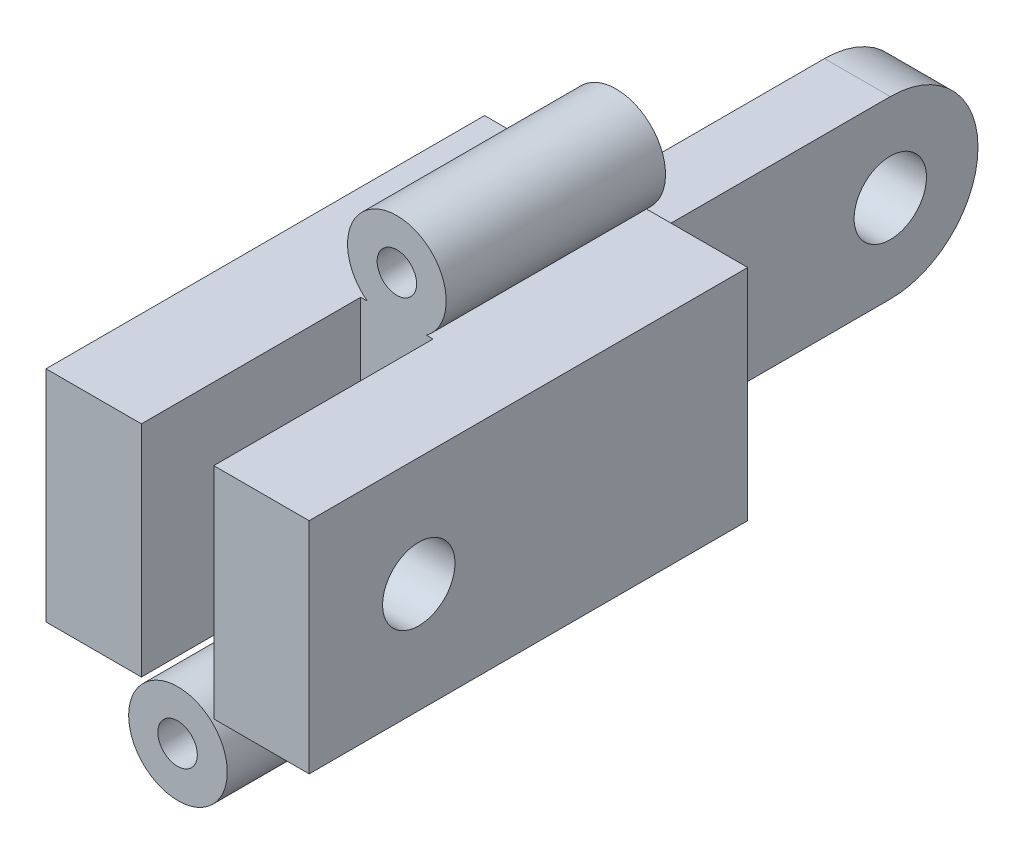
ISO-10303-21;
HEADER;
FILE_DESCRIPTION(('STEP AP214'),'2;1');
FILE_NAME('part.step','',(''),(''),'','','');
FILE_SCHEMA(('AUTOMOTIVE_DESIGN { 1 0 10303 214 1 1 1 1 }'));
ENDSEC;
DATA;
#1=APPLICATION_CONTEXT('core data for automotive mechanical design processes');
#2=APPLICATION_PROTOCOL_DEFINITION('international standard','automotive_design',2000,#1);
#3=PRODUCT_CONTEXT('',#1,'mechanical');
#4=PRODUCT('Part','Part','',(#3));
#5=PRODUCT_RELATED_PRODUCT_CATEGORY('part','',(#4));
#6=PRODUCT_DEFINITION_FORMATION('','',#4);
#7=PRODUCT_DEFINITION_CONTEXT('part definition',#1,'design');
#8=PRODUCT_DEFINITION('design','',#6,#7);
#9=PRODUCT_DEFINITION_SHAPE('','',#8);
#10=(LENGTH_UNIT() NAMED_UNIT(*) SI_UNIT(.MILLI.,.METRE.));
#11=(NAMED_UNIT(*) PLANE_ANGLE_UNIT() SI_UNIT($,.RADIAN.));
#12=(NAMED_UNIT(*) SI_UNIT($,.STERADIAN.) SOLID_ANGLE_UNIT());
#13=UNCERTAINTY_MEASURE_WITH_UNIT(LENGTH_MEASURE(1.E-05),#10,'distance_accuracy_value','');
#14=(GEOMETRIC_REPRESENTATION_CONTEXT(3) GLOBAL_UNCERTAINTY_ASSIGNED_CONTEXT((#13)) GLOBAL_UNIT_ASSIGNED_CONTEXT((#10,
#11,#12)) REPRESENTATION_CONTEXT('',''));
#15=CARTESIAN_POINT('',(0.,0.,0.));
#16=DIRECTION('',(0.,0.,1.));
#17=DIRECTION('',(1.,0.,0.));
#18=AXIS2_PLACEMENT_3D('',#15,#16,#17);
#19=CARTESIAN_POINT('',(0.,0.,0.));
#20=DIRECTION('',(0.,-1.,0.));
#21=DIRECTION('',(0.,0.,-1.));
#22=AXIS2_PLACEMENT_3D('',#19,#20,#21);
#23=PLANE('',#22);
#24=DIRECTION('',(0.,0.,-1.));
#25=VECTOR('',#24,1.);
#26=CARTESIAN_POINT('',(4.66804126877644,0.,0.));
#27=LINE('',#26,#25);
#28=CARTESIAN_POINT('',(4.66804126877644,0.,-10.));
#29=VERTEX_POINT('',#28);
#30=CARTESIAN_POINT('',(4.66804126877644,0.,-20.));
#31=VERTEX_POINT('',#30);
#32=EDGE_CURVE('E11',#29,#31,#27,.T.);
#33=ORIENTED_EDGE('',*,*,#32,.F.);
#34=DIRECTION('',(1.,0.,0.));
#35=VECTOR('',#34,1.);
#36=CARTESIAN_POINT('',(4.35,0.,-10.));
#37=LINE('',#36,#35);
#38=CARTESIAN_POINT('',(4.35,0.,-10.));
#39=VERTEX_POINT('',#38);
#40=EDGE_CURVE('E363',#39,#29,#37,.T.);
#41=ORIENTED_EDGE('',*,*,#40,.F.);
#42=DIRECTION('',(0.,0.,-1.));
#43=VECTOR('',#42,1.);
#44=CARTESIAN_POINT('',(4.35,0.,0.));
#45=LINE('',#44,#43);
#46=CARTESIAN_POINT('',(4.35,0.,0.));
#47=VERTEX_POINT('',#46);
#48=EDGE_CURVE('E360',#47,#39,#45,.T.);
#49=ORIENTED_EDGE('',*,*,#48,.F.);
#50=DIRECTION('',(1.,0.,0.));
#51=VECTOR('',#50,1.);
#52=CARTESIAN_POINT('',(0.,0.,0.));
#53=LINE('',#52,#51);
#54=CARTESIAN_POINT('',(0.,0.,0.));
#55=VERTEX_POINT('',#54);
#56=EDGE_CURVE('E357',#55,#47,#53,.T.);
#57=ORIENTED_EDGE('',*,*,#56,.F.);
#58=DIRECTION('',(0.,0.,1.));
#59=VECTOR('',#58,1.);
#60=CARTESIAN_POINT('',(0.,0.,0.));
#61=LINE('',#60,#59);
#62=CARTESIAN_POINT('',(0.,0.,-20.));
#63=VERTEX_POINT('',#62);
#64=EDGE_CURVE('E244',#63,#55,#61,.T.);
#65=ORIENTED_EDGE('',*,*,#64,.F.);
#66=DIRECTION('',(-1.,0.,0.));
#67=VECTOR('',#66,1.);
#68=CARTESIAN_POINT('',(0.,0.,-20.));
#69=LINE('',#68,#67);
#70=EDGE_CURVE('E189',#31,#63,#69,.T.);
#71=ORIENTED_EDGE('',*,*,#70,.F.);
#72=EDGE_LOOP('',(#33,#41,#49,#57,#65,#71));
#73=FACE_BOUND('',#72,.T.);
#74=ADVANCED_FACE('F45',(#73),#23,.T.);
#75=CARTESIAN_POINT('',(0.,10.,0.));
#76=DIRECTION('',(0.,-1.,0.));
#77=DIRECTION('',(0.,0.,-1.));
#78=AXIS2_PLACEMENT_3D('',#75,#76,#77);
#79=PLANE('',#78);
#80=DIRECTION('',(-1.,0.,0.));
#81=VECTOR('',#80,1.);
#82=CARTESIAN_POINT('',(12.,10.,-20.));
#83=LINE('',#82,#81);
#84=CARTESIAN_POINT('',(12.,10.,-20.));
#85=VERTEX_POINT('',#84);
#86=CARTESIAN_POINT('',(7.35,10.,-20.));
#87=VERTEX_POINT('',#86);
#88=EDGE_CURVE('E205',#85,#87,#83,.T.);
#89=ORIENTED_EDGE('',*,*,#88,.T.);
#90=DIRECTION('',(0.,0.,1.));
#91=VECTOR('',#90,1.);
#92=CARTESIAN_POINT('',(7.35,10.,-20.));
#93=LINE('',#92,#91);
#94=CARTESIAN_POINT('',(7.35,10.,-10.));
#95=VERTEX_POINT('',#94);
#96=EDGE_CURVE('E180',#87,#95,#93,.T.);
#97=ORIENTED_EDGE('',*,*,#96,.T.);
#98=DIRECTION('',(1.,0.,0.));
#99=VECTOR('',#98,1.);
#100=CARTESIAN_POINT('',(4.35,10.,-10.));
#101=LINE('',#100,#99);
#102=CARTESIAN_POINT('',(7.65,10.,-10.));
#103=VERTEX_POINT('',#102);
#104=EDGE_CURVE('E279',#95,#103,#101,.T.);
#105=ORIENTED_EDGE('',*,*,#104,.T.);
#106=DIRECTION('',(0.,0.,1.));
#107=VECTOR('',#106,1.);
#108=CARTESIAN_POINT('',(7.65,10.,0.));
#109=LINE('',#108,#107);
#110=CARTESIAN_POINT('',(7.65,10.,0.));
#111=VERTEX_POINT('',#110);
#112=EDGE_CURVE('E342',#103,#111,#109,.T.);
#113=ORIENTED_EDGE('',*,*,#112,.T.);
#114=DIRECTION('',(1.,0.,0.));
#115=VECTOR('',#114,1.);
#116=CARTESIAN_POINT('',(7.65,10.,0.));
#117=LINE('',#116,#115);
#118=CARTESIAN_POINT('',(12.,10.,0.));
#119=VERTEX_POINT('',#118);
#120=EDGE_CURVE('E345',#111,#119,#117,.T.);
#121=ORIENTED_EDGE('',*,*,#120,.T.);
#122=DIRECTION('',(0.,0.,-1.));
#123=VECTOR('',#122,1.);
#124=CARTESIAN_POINT('',(12.,10.,0.));
#125=LINE('',#124,#123);
#126=EDGE_CURVE('E348',#119,#85,#125,.T.);
#127=ORIENTED_EDGE('',*,*,#126,.T.);
#128=EDGE_LOOP('',(#89,#97,#105,#113,#121,#127));
#129=FACE_BOUND('',#128,.T.);
#130=ADVANCED_FACE('F278',(#129),#79,.F.);
#131=CARTESIAN_POINT('',(0.,10.,0.));
#132=DIRECTION('',(1.,0.,0.));
#133=DIRECTION('',(0.,0.,-1.));
#134=AXIS2_PLACEMENT_3D('',#131,#132,#133);
#135=PLANE('',#134);
#136=CARTESIAN_POINT('',(0.,5.,-5.));
#137=DIRECTION('',(1.,0.,0.));
#138=DIRECTION('',(0.,0.,-1.));
#139=AXIS2_PLACEMENT_3D('',#136,#137,#138);
#140=CIRCLE('',#139,1.65);
#141=CARTESIAN_POINT('',(0.,5.,-6.65));
#142=VERTEX_POINT('',#141);
#143=EDGE_CURVE('E298',#142,#142,#140,.T.);
#144=ORIENTED_EDGE('',*,*,#143,.T.);
#145=EDGE_LOOP('',(#144));
#146=FACE_BOUND('',#145,.T.);
#147=ORIENTED_EDGE('',*,*,#64,.T.);
#148=DIRECTION('',(0.,-1.,0.));
#149=VECTOR('',#148,1.);
#150=CARTESIAN_POINT('',(0.,10.,0.));
#151=LINE('',#150,#149);
#152=CARTESIAN_POINT('',(0.,10.,0.));
#153=VERTEX_POINT('',#152);
#154=EDGE_CURVE('E235',#153,#55,#151,.T.);
#155=ORIENTED_EDGE('',*,*,#154,.F.);
#156=DIRECTION('',(0.,0.,1.));
#157=VECTOR('',#156,1.);
#158=CARTESIAN_POINT('',(0.,10.,0.));
#159=LINE('',#158,#157);
#160=CARTESIAN_POINT('',(0.,10.,-20.));
#161=VERTEX_POINT('',#160);
#162=EDGE_CURVE('E188',#161,#153,#159,.T.);
#163=ORIENTED_EDGE('',*,*,#162,.F.);
#164=DIRECTION('',(0.,-1.,0.));
#165=VECTOR('',#164,1.);
#166=CARTESIAN_POINT('',(0.,10.,-20.));
#167=LINE('',#166,#165);
#168=EDGE_CURVE('E200',#161,#63,#167,.T.);
#169=ORIENTED_EDGE('',*,*,#168,.T.);
#170=EDGE_LOOP('',(#147,#155,#163,#169));
#171=FACE_BOUND('',#170,.T.);
#172=ADVANCED_FACE('F406',(#146,#171),#135,.F.);
#173=CARTESIAN_POINT('',(0.,10.,0.));
#174=DIRECTION('',(0.,0.,-1.));
#175=DIRECTION('',(-1.,0.,0.));
#176=AXIS2_PLACEMENT_3D('',#173,#174,#175);
#177=PLANE('',#176);
#178=ORIENTED_EDGE('',*,*,#56,.T.);
#179=DIRECTION('',(0.,-1.,0.));
#180=VECTOR('',#179,1.);
#181=CARTESIAN_POINT('',(4.35,10.,0.));
#182=LINE('',#181,#180);
#183=CARTESIAN_POINT('',(4.35,10.,0.));
#184=VERTEX_POINT('',#183);
#185=EDGE_CURVE('E231',#184,#47,#182,.T.);
#186=ORIENTED_EDGE('',*,*,#185,.F.);
#187=DIRECTION('',(1.,0.,0.));
#188=VECTOR('',#187,1.);
#189=CARTESIAN_POINT('',(0.,10.,0.));
#190=LINE('',#189,#188);
#191=EDGE_CURVE('E194',#153,#184,#190,.T.);
#192=ORIENTED_EDGE('',*,*,#191,.F.);
#193=ORIENTED_EDGE('',*,*,#154,.T.);
#194=EDGE_LOOP('',(#178,#186,#192,#193));
#195=FACE_BOUND('',#194,.T.);
#196=ADVANCED_FACE('F495',(#195),#177,.F.);
#197=CARTESIAN_POINT('',(4.35,10.,0.));
#198=DIRECTION('',(-1.,0.,0.));
#199=DIRECTION('',(0.,0.,1.));
#200=AXIS2_PLACEMENT_3D('',#197,#198,#199);
#201=PLANE('',#200);
#202=CARTESIAN_POINT('',(4.35,5.,-5.));
#203=DIRECTION('',(-1.,0.,0.));
#204=DIRECTION('',(0.,0.,1.));
#205=AXIS2_PLACEMENT_3D('',#202,#203,#204);
#206=CIRCLE('',#205,1.65);
#207=CARTESIAN_POINT('',(4.35,5.,-6.65));
#208=VERTEX_POINT('',#207);
#209=EDGE_CURVE('E270',#208,#208,#206,.T.);
#210=ORIENTED_EDGE('',*,*,#209,.T.);
#211=EDGE_LOOP('',(#210));
#212=FACE_BOUND('',#211,.T.);
#213=ORIENTED_EDGE('',*,*,#48,.T.);
#214=DIRECTION('',(0.,-1.,0.));
#215=VECTOR('',#214,1.);
#216=CARTESIAN_POINT('',(4.35,10.,-10.));
#217=LINE('',#216,#215);
#218=CARTESIAN_POINT('',(4.35,10.,-10.));
#219=VERTEX_POINT('',#218);
#220=EDGE_CURVE('E227',#219,#39,#217,.T.);
#221=ORIENTED_EDGE('',*,*,#220,.F.);
#222=DIRECTION('',(0.,0.,-1.));
#223=VECTOR('',#222,1.);
#224=CARTESIAN_POINT('',(4.35,10.,0.));
#225=LINE('',#224,#223);
#226=EDGE_CURVE('E337',#184,#219,#225,.T.);
#227=ORIENTED_EDGE('',*,*,#226,.F.);
#228=ORIENTED_EDGE('',*,*,#185,.T.);
#229=EDGE_LOOP('',(#213,#221,#227,#228));
#230=FACE_BOUND('',#229,.T.);
#231=ADVANCED_FACE('F479',(#212,#230),#201,.F.);
#232=CARTESIAN_POINT('',(4.35,10.,-10.));
#233=DIRECTION('',(0.,0.,-1.));
#234=DIRECTION('',(-1.,0.,0.));
#235=AXIS2_PLACEMENT_3D('',#232,#233,#234);
#236=PLANE('',#235);
#237=CARTESIAN_POINT('',(6.,11.8,-10.));
#238=DIRECTION('',(0.,0.,-1.));
#239=DIRECTION('',(-1.,0.,0.));
#240=AXIS2_PLACEMENT_3D('',#237,#238,#239);
#241=CIRCLE('',#240,0.899999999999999);
#242=CARTESIAN_POINT('',(5.1,11.8,-10.));
#243=VERTEX_POINT('',#242);
#244=EDGE_CURVE('E169',#243,#243,#241,.T.);
#245=ORIENTED_EDGE('',*,*,#244,.T.);
#246=EDGE_LOOP('',(#245));
#247=FACE_BOUND('',#246,.T.);
#248=ORIENTED_EDGE('',*,*,#40,.T.);
#249=CARTESIAN_POINT('',(6.01804126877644,-1.8,-10.));
#250=DIRECTION('',(0.,0.,-1.));
#251=DIRECTION('',(-1.,0.,0.));
#252=AXIS2_PLACEMENT_3D('',#249,#250,#251);
#253=CIRCLE('',#252,2.25);
#254=CARTESIAN_POINT('',(7.36804126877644,0.,-10.));
#255=VERTEX_POINT('',#254);
#256=EDGE_CURVE('E290',#29,#255,#253,.T.);
#257=ORIENTED_EDGE('',*,*,#256,.T.);
#258=CARTESIAN_POINT('',(7.65,0.,-10.));
#259=VERTEX_POINT('',#258);
#260=EDGE_CURVE('E178',#255,#259,#37,.T.);
#261=ORIENTED_EDGE('',*,*,#260,.T.);
#262=DIRECTION('',(0.,-1.,0.));
#263=VECTOR('',#262,1.);
#264=CARTESIAN_POINT('',(7.65,10.,-10.));
#265=LINE('',#264,#263);
#266=EDGE_CURVE('E223',#103,#259,#265,.T.);
#267=ORIENTED_EDGE('',*,*,#266,.F.);
#268=ORIENTED_EDGE('',*,*,#104,.F.);
#269=CARTESIAN_POINT('',(6.,11.8,-10.));
#270=DIRECTION('',(0.,0.,1.));
#271=DIRECTION('',(1.,0.,0.));
#272=AXIS2_PLACEMENT_3D('',#269,#270,#271);
#273=CIRCLE('',#272,2.25);
#274=CARTESIAN_POINT('',(4.65,10.,-10.));
#275=VERTEX_POINT('',#274);
#276=EDGE_CURVE('E285',#95,#275,#273,.T.);
#277=ORIENTED_EDGE('',*,*,#276,.T.);
#278=EDGE_CURVE('E68',#219,#275,#101,.T.);
#279=ORIENTED_EDGE('',*,*,#278,.F.);
#280=ORIENTED_EDGE('',*,*,#220,.T.);
#281=EDGE_LOOP('',(#248,#257,#261,#267,#268,#277,#279,#280));
#282=FACE_BOUND('',#281,.T.);
#283=ADVANCED_FACE('F395',(#247,#282),#236,.F.);
#284=CARTESIAN_POINT('',(7.65,10.,0.));
#285=DIRECTION('',(1.,0.,0.));
#286=DIRECTION('',(0.,0.,-1.));
#287=AXIS2_PLACEMENT_3D('',#284,#285,#286);
#288=PLANE('',#287);
#289=CARTESIAN_POINT('',(7.65,5.,-5.));
#290=DIRECTION('',(1.,0.,0.));
#291=DIRECTION('',(0.,0.,-1.));
#292=AXIS2_PLACEMENT_3D('',#289,#290,#291);
#293=CIRCLE('',#292,1.65);
#294=CARTESIAN_POINT('',(7.65,5.,-6.65));
#295=VERTEX_POINT('',#294);
#296=EDGE_CURVE('E302',#295,#295,#293,.T.);
#297=ORIENTED_EDGE('',*,*,#296,.T.);
#298=EDGE_LOOP('',(#297));
#299=FACE_BOUND('',#298,.T.);
#300=DIRECTION('',(0.,0.,1.));
#301=VECTOR('',#300,1.);
#302=CARTESIAN_POINT('',(7.65,0.,0.));
#303=LINE('',#302,#301);
#304=CARTESIAN_POINT('',(7.65,0.,0.));
#305=VERTEX_POINT('',#304);
#306=EDGE_CURVE('E367',#259,#305,#303,.T.);
#307=ORIENTED_EDGE('',*,*,#306,.T.);
#308=DIRECTION('',(0.,-1.,0.));
#309=VECTOR('',#308,1.);
#310=CARTESIAN_POINT('',(7.65,10.,0.));
#311=LINE('',#310,#309);
#312=EDGE_CURVE('E219',#111,#305,#311,.T.);
#313=ORIENTED_EDGE('',*,*,#312,.F.);
#314=ORIENTED_EDGE('',*,*,#112,.F.);
#315=ORIENTED_EDGE('',*,*,#266,.T.);
#316=EDGE_LOOP('',(#307,#313,#314,#315));
#317=FACE_BOUND('',#316,.T.);
#318=ADVANCED_FACE('F380',(#299,#317),#288,.F.);
#319=CARTESIAN_POINT('',(7.65,10.,0.));
#320=DIRECTION('',(0.,0.,-1.));
#321=DIRECTION('',(-1.,0.,0.));
#322=AXIS2_PLACEMENT_3D('',#319,#320,#321);
#323=PLANE('',#322);
#324=DIRECTION('',(1.,0.,0.));
#325=VECTOR('',#324,1.);
#326=CARTESIAN_POINT('',(7.65,0.,0.));
#327=LINE('',#326,#325);
#328=CARTESIAN_POINT('',(12.,0.,0.));
#329=VERTEX_POINT('',#328);
#330=EDGE_CURVE('E369',#305,#329,#327,.T.);
#331=ORIENTED_EDGE('',*,*,#330,.T.);
#332=DIRECTION('',(0.,-1.,0.));
#333=VECTOR('',#332,1.);
#334=CARTESIAN_POINT('',(12.,10.,0.));
#335=LINE('',#334,#333);
#336=EDGE_CURVE('E215',#119,#329,#335,.T.);
#337=ORIENTED_EDGE('',*,*,#336,.F.);
#338=ORIENTED_EDGE('',*,*,#120,.F.);
#339=ORIENTED_EDGE('',*,*,#312,.T.);
#340=EDGE_LOOP('',(#331,#337,#338,#339));
#341=FACE_BOUND('',#340,.T.);
#342=ADVANCED_FACE('F383',(#341),#323,.F.);
#343=CARTESIAN_POINT('',(12.,10.,0.));
#344=DIRECTION('',(-1.,0.,0.));
#345=DIRECTION('',(0.,0.,1.));
#346=AXIS2_PLACEMENT_3D('',#343,#344,#345);
#347=PLANE('',#346);
#348=CARTESIAN_POINT('',(12.,5.,-5.));
#349=DIRECTION('',(1.,0.,0.));
#350=DIRECTION('',(0.,0.,-1.));
#351=AXIS2_PLACEMENT_3D('',#348,#349,#350);
#352=CIRCLE('',#351,1.65);
#353=CARTESIAN_POINT('',(12.,5.,-6.65));
#354=VERTEX_POINT('',#353);
#355=EDGE_CURVE('E294',#354,#354,#352,.T.);
#356=ORIENTED_EDGE('',*,*,#355,.F.);
#357=EDGE_LOOP('',(#356));
#358=FACE_BOUND('',#357,.T.);
#359=DIRECTION('',(0.,0.,-1.));
#360=VECTOR('',#359,1.);
#361=CARTESIAN_POINT('',(12.,0.,0.));
#362=LINE('',#361,#360);
#363=CARTESIAN_POINT('',(12.,0.,-20.));
#364=VERTEX_POINT('',#363);
#365=EDGE_CURVE('E196',#329,#364,#362,.T.);
#366=ORIENTED_EDGE('',*,*,#365,.T.);
#367=DIRECTION('',(0.,-1.,0.));
#368=VECTOR('',#367,1.);
#369=CARTESIAN_POINT('',(12.,10.,-20.));
#370=LINE('',#369,#368);
#371=EDGE_CURVE('E186',#85,#364,#370,.T.);
#372=ORIENTED_EDGE('',*,*,#371,.F.);
#373=ORIENTED_EDGE('',*,*,#126,.F.);
#374=ORIENTED_EDGE('',*,*,#336,.T.);
#375=EDGE_LOOP('',(#366,#372,#373,#374));
#376=FACE_BOUND('',#375,.T.);
#377=ADVANCED_FACE('F376',(#358,#376),#347,.F.);
#378=CARTESIAN_POINT('',(7.5,10.,-35.));
#379=DIRECTION('',(-1.,0.,0.));
#380=DIRECTION('',(0.,0.,1.));
#381=AXIS2_PLACEMENT_3D('',#378,#379,#380);
#382=PLANE('',#381);
#383=CARTESIAN_POINT('',(7.5,5.,-31.));
#384=DIRECTION('',(1.,0.,0.));
#385=DIRECTION('',(0.,0.,-1.));
#386=AXIS2_PLACEMENT_3D('',#383,#384,#385);
#387=CIRCLE('',#386,1.65);
#388=CARTESIAN_POINT('',(7.5,5.,-32.65));
#389=VERTEX_POINT('',#388);
#390=EDGE_CURVE('E320',#389,#389,#387,.T.);
#391=ORIENTED_EDGE('',*,*,#390,.F.);
#392=EDGE_LOOP('',(#391));
#393=FACE_BOUND('',#392,.T.);
#394=DIRECTION('',(0.,0.,1.));
#395=VECTOR('',#394,1.);
#396=CARTESIAN_POINT('',(7.5,1.,-20.));
#397=LINE('',#396,#395);
#398=CARTESIAN_POINT('',(7.5,0.999999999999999,-31.));
#399=VERTEX_POINT('',#398);
#400=CARTESIAN_POINT('',(7.5,1.,-20.));
#401=VERTEX_POINT('',#400);
#402=EDGE_CURVE('E316',#399,#401,#397,.T.);
#403=ORIENTED_EDGE('',*,*,#402,.F.);
#404=CARTESIAN_POINT('',(7.5,5.,-31.));
#405=DIRECTION('',(-1.,0.,0.));
#406=DIRECTION('',(0.,0.,1.));
#407=AXIS2_PLACEMENT_3D('',#404,#405,#406);
#408=CIRCLE('',#407,4.);
#409=CARTESIAN_POINT('',(7.5,5.,-35.));
#410=VERTEX_POINT('',#409);
#411=EDGE_CURVE('E252',#399,#410,#408,.F.);
#412=ORIENTED_EDGE('',*,*,#411,.T.);
#413=CARTESIAN_POINT('',(7.5,5.,-31.));
#414=DIRECTION('',(-1.,0.,0.));
#415=DIRECTION('',(0.,0.,1.));
#416=AXIS2_PLACEMENT_3D('',#413,#414,#415);
#417=CIRCLE('',#416,4.);
#418=CARTESIAN_POINT('',(7.5,9.,-31.));
#419=VERTEX_POINT('',#418);
#420=EDGE_CURVE('E249',#410,#419,#417,.F.);
#421=ORIENTED_EDGE('',*,*,#420,.T.);
#422=DIRECTION('',(0.,0.,-1.));
#423=VECTOR('',#422,1.);
#424=CARTESIAN_POINT('',(7.5,9.,-20.));
#425=LINE('',#424,#423);
#426=CARTESIAN_POINT('',(7.5,9.,-20.));
#427=VERTEX_POINT('',#426);
#428=EDGE_CURVE('E315',#427,#419,#425,.T.);
#429=ORIENTED_EDGE('',*,*,#428,.F.);
#430=DIRECTION('',(0.,-1.,0.));
#431=VECTOR('',#430,1.);
#432=CARTESIAN_POINT('',(7.5,10.,-20.));
#433=LINE('',#432,#431);
#434=EDGE_CURVE('E209',#427,#401,#433,.T.);
#435=ORIENTED_EDGE('',*,*,#434,.T.);
#436=EDGE_LOOP('',(#403,#412,#421,#429,#435));
#437=FACE_BOUND('',#436,.T.);
#438=ADVANCED_FACE('F391',(#393,#437),#382,.F.);
#439=CARTESIAN_POINT('',(4.5,10.,-35.));
#440=DIRECTION('',(1.,0.,0.));
#441=DIRECTION('',(0.,0.,-1.));
#442=AXIS2_PLACEMENT_3D('',#439,#440,#441);
#443=PLANE('',#442);
#444=CARTESIAN_POINT('',(4.5,5.,-31.));
#445=DIRECTION('',(1.,0.,0.));
#446=DIRECTION('',(0.,0.,-1.));
#447=AXIS2_PLACEMENT_3D('',#444,#445,#446);
#448=CIRCLE('',#447,1.65);
#449=CARTESIAN_POINT('',(4.5,5.,-32.65));
#450=VERTEX_POINT('',#449);
#451=EDGE_CURVE('E240',#450,#450,#448,.T.);
#452=ORIENTED_EDGE('',*,*,#451,.T.);
#453=EDGE_LOOP('',(#452));
#454=FACE_BOUND('',#453,.T.);
#455=CARTESIAN_POINT('',(4.5,5.,-31.));
#456=DIRECTION('',(1.,0.,0.));
#457=DIRECTION('',(0.,0.,-1.));
#458=AXIS2_PLACEMENT_3D('',#455,#456,#457);
#459=CIRCLE('',#458,4.);
#460=CARTESIAN_POINT('',(4.5,9.,-31.));
#461=VERTEX_POINT('',#460);
#462=CARTESIAN_POINT('',(4.5,5.,-35.));
#463=VERTEX_POINT('',#462);
#464=EDGE_CURVE('E255',#461,#463,#459,.F.);
#465=ORIENTED_EDGE('',*,*,#464,.T.);
#466=CARTESIAN_POINT('',(4.5,5.,-31.));
#467=DIRECTION('',(1.,0.,0.));
#468=DIRECTION('',(0.,0.,-1.));
#469=AXIS2_PLACEMENT_3D('',#466,#467,#468);
#470=CIRCLE('',#469,4.);
#471=CARTESIAN_POINT('',(4.5,0.999999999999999,-31.));
#472=VERTEX_POINT('',#471);
#473=EDGE_CURVE('E258',#463,#472,#470,.F.);
#474=ORIENTED_EDGE('',*,*,#473,.T.);
#475=DIRECTION('',(0.,0.,1.));
#476=VECTOR('',#475,1.);
#477=CARTESIAN_POINT('',(4.5,0.999999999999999,-35.));
#478=LINE('',#477,#476);
#479=CARTESIAN_POINT('',(4.5,1.,-20.));
#480=VERTEX_POINT('',#479);
#481=EDGE_CURVE('E245',#472,#480,#478,.T.);
#482=ORIENTED_EDGE('',*,*,#481,.T.);
#483=DIRECTION('',(0.,-1.,0.));
#484=VECTOR('',#483,1.);
#485=CARTESIAN_POINT('',(4.5,10.,-20.));
#486=LINE('',#485,#484);
#487=CARTESIAN_POINT('',(4.5,9.,-20.));
#488=VERTEX_POINT('',#487);
#489=EDGE_CURVE('E204',#488,#480,#486,.T.);
#490=ORIENTED_EDGE('',*,*,#489,.F.);
#491=DIRECTION('',(0.,0.,-1.));
#492=VECTOR('',#491,1.);
#493=CARTESIAN_POINT('',(4.5,9.,-35.));
#494=LINE('',#493,#492);
#495=EDGE_CURVE('E329',#488,#461,#494,.T.);
#496=ORIENTED_EDGE('',*,*,#495,.T.);
#497=EDGE_LOOP('',(#465,#474,#482,#490,#496));
#498=FACE_BOUND('',#497,.T.);
#499=ADVANCED_FACE('F422',(#454,#498),#443,.F.);
#500=CARTESIAN_POINT('',(0.,10.,-20.));
#501=DIRECTION('',(0.,0.,1.));
#502=DIRECTION('',(1.,0.,0.));
#503=AXIS2_PLACEMENT_3D('',#500,#501,#502);
#504=PLANE('',#503);
#505=CARTESIAN_POINT('',(6.,-1.8,-20.));
#506=DIRECTION('',(0.,0.,-1.));
#507=DIRECTION('',(-1.,0.,0.));
#508=AXIS2_PLACEMENT_3D('',#505,#506,#507);
#509=CIRCLE('',#508,0.899999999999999);
#510=CARTESIAN_POINT('',(5.1,-1.8,-20.));
#511=VERTEX_POINT('',#510);
#512=EDGE_CURVE('E458',#511,#511,#509,.T.);
#513=ORIENTED_EDGE('',*,*,#512,.F.);
#514=EDGE_LOOP('',(#513));
#515=FACE_BOUND('',#514,.T.);
#516=CARTESIAN_POINT('',(6.,11.8,-20.));
#517=DIRECTION('',(0.,0.,-1.));
#518=DIRECTION('',(-1.,0.,0.));
#519=AXIS2_PLACEMENT_3D('',#516,#517,#518);
#520=CIRCLE('',#519,0.899999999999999);
#521=CARTESIAN_POINT('',(5.1,11.8,-20.));
#522=VERTEX_POINT('',#521);
#523=EDGE_CURVE('E460',#522,#522,#520,.T.);
#524=ORIENTED_EDGE('',*,*,#523,.F.);
#525=EDGE_LOOP('',(#524));
#526=FACE_BOUND('',#525,.T.);
#527=CARTESIAN_POINT('',(7.36804126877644,0.,-20.));
#528=VERTEX_POINT('',#527);
#529=EDGE_CURVE('E175',#364,#528,#69,.T.);
#530=ORIENTED_EDGE('',*,*,#529,.T.);
#531=CARTESIAN_POINT('',(6.01804126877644,-1.8,-20.));
#532=DIRECTION('',(0.,0.,-1.));
#533=DIRECTION('',(-1.,0.,0.));
#534=AXIS2_PLACEMENT_3D('',#531,#532,#533);
#535=CIRCLE('',#534,2.25);
#536=EDGE_CURVE('E61',#528,#31,#535,.T.);
#537=ORIENTED_EDGE('',*,*,#536,.T.);
#538=ORIENTED_EDGE('',*,*,#70,.T.);
#539=ORIENTED_EDGE('',*,*,#168,.F.);
#540=CARTESIAN_POINT('',(4.65,10.,-20.));
#541=VERTEX_POINT('',#540);
#542=EDGE_CURVE('E351',#541,#161,#83,.T.);
#543=ORIENTED_EDGE('',*,*,#542,.F.);
#544=CARTESIAN_POINT('',(6.,11.8,-20.));
#545=DIRECTION('',(0.,0.,1.));
#546=DIRECTION('',(1.,0.,0.));
#547=AXIS2_PLACEMENT_3D('',#544,#545,#546);
#548=CIRCLE('',#547,2.25);
#549=EDGE_CURVE('E289',#87,#541,#548,.T.);
#550=ORIENTED_EDGE('',*,*,#549,.F.);
#551=ORIENTED_EDGE('',*,*,#88,.F.);
#552=ORIENTED_EDGE('',*,*,#371,.T.);
#553=EDGE_LOOP('',(#530,#537,#538,#539,#543,#550,#551,#552));
#554=FACE_BOUND('',#553,.T.);
#555=ORIENTED_EDGE('',*,*,#489,.T.);
#556=DIRECTION('',(1.,0.,0.));
#557=VECTOR('',#556,1.);
#558=CARTESIAN_POINT('',(-2.5,1.,-20.));
#559=LINE('',#558,#557);
#560=EDGE_CURVE('E269',#480,#401,#559,.T.);
#561=ORIENTED_EDGE('',*,*,#560,.T.);
#562=ORIENTED_EDGE('',*,*,#434,.F.);
#563=DIRECTION('',(1.,0.,0.));
#564=VECTOR('',#563,1.);
#565=CARTESIAN_POINT('',(-2.5,9.,-20.));
#566=LINE('',#565,#564);
#567=EDGE_CURVE('E312',#488,#427,#566,.T.);
#568=ORIENTED_EDGE('',*,*,#567,.F.);
#569=EDGE_LOOP('',(#555,#561,#562,#568));
#570=FACE_BOUND('',#569,.T.);
#571=ADVANCED_FACE('F182',(#515,#526,#554,#570),#504,.F.);
#572=ORIENTED_EDGE('',*,*,#278,.T.);
#573=DIRECTION('',(0.,0.,1.));
#574=VECTOR('',#573,1.);
#575=CARTESIAN_POINT('',(4.65,10.,-20.));
#576=LINE('',#575,#574);
#577=EDGE_CURVE('E264',#275,#541,#576,.F.);
#578=ORIENTED_EDGE('',*,*,#577,.T.);
#579=ORIENTED_EDGE('',*,*,#542,.T.);
#580=ORIENTED_EDGE('',*,*,#162,.T.);
#581=ORIENTED_EDGE('',*,*,#191,.T.);
#582=ORIENTED_EDGE('',*,*,#226,.T.);
#583=EDGE_LOOP('',(#572,#578,#579,#580,#581,#582));
#584=FACE_BOUND('',#583,.T.);
#585=ADVANCED_FACE('F408',(#584),#79,.F.);
#586=DIRECTION('',(0.,0.,-1.));
#587=VECTOR('',#586,1.);
#588=CARTESIAN_POINT('',(7.36804126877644,0.,0.));
#589=LINE('',#588,#587);
#590=EDGE_CURVE('E54',#528,#255,#589,.F.);
#591=ORIENTED_EDGE('',*,*,#590,.F.);
#592=ORIENTED_EDGE('',*,*,#529,.F.);
#593=ORIENTED_EDGE('',*,*,#365,.F.);
#594=ORIENTED_EDGE('',*,*,#330,.F.);
#595=ORIENTED_EDGE('',*,*,#306,.F.);
#596=ORIENTED_EDGE('',*,*,#260,.F.);
#597=EDGE_LOOP('',(#591,#592,#593,#594,#595,#596));
#598=FACE_BOUND('',#597,.T.);
#599=ADVANCED_FACE('F173',(#598),#23,.T.);
#600=CARTESIAN_POINT('',(-2.5,1.,-20.));
#601=DIRECTION('',(0.,1.,0.));
#602=DIRECTION('',(0.,0.,1.));
#603=AXIS2_PLACEMENT_3D('',#600,#601,#602);
#604=PLANE('',#603);
#605=ORIENTED_EDGE('',*,*,#481,.F.);
#606=DIRECTION('',(1.,0.,0.));
#607=VECTOR('',#606,1.);
#608=CARTESIAN_POINT('',(-2.5,0.999999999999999,-31.));
#609=LINE('',#608,#607);
#610=EDGE_CURVE('E239',#472,#399,#609,.T.);
#611=ORIENTED_EDGE('',*,*,#610,.T.);
#612=ORIENTED_EDGE('',*,*,#402,.T.);
#613=ORIENTED_EDGE('',*,*,#560,.F.);
#614=EDGE_LOOP('',(#605,#611,#612,#613));
#615=FACE_BOUND('',#614,.T.);
#616=ADVANCED_FACE('F410',(#615),#604,.F.);
#617=CARTESIAN_POINT('',(-2.5,9.,-20.));
#618=DIRECTION('',(0.,-1.,0.));
#619=DIRECTION('',(0.,0.,-1.));
#620=AXIS2_PLACEMENT_3D('',#617,#618,#619);
#621=PLANE('',#620);
#622=ORIENTED_EDGE('',*,*,#428,.T.);
#623=DIRECTION('',(1.,0.,0.));
#624=VECTOR('',#623,1.);
#625=CARTESIAN_POINT('',(-2.5,9.,-31.));
#626=LINE('',#625,#624);
#627=EDGE_CURVE('E261',#419,#461,#626,.F.);
#628=ORIENTED_EDGE('',*,*,#627,.T.);
#629=ORIENTED_EDGE('',*,*,#495,.F.);
#630=ORIENTED_EDGE('',*,*,#567,.T.);
#631=EDGE_LOOP('',(#622,#628,#629,#630));
#632=FACE_BOUND('',#631,.T.);
#633=ADVANCED_FACE('F415',(#632),#621,.F.);
#634=CARTESIAN_POINT('',(-2.5,5.,-31.));
#635=DIRECTION('',(1.,0.,0.));
#636=DIRECTION('',(0.,0.,-1.));
#637=AXIS2_PLACEMENT_3D('',#634,#635,#636);
#638=CYLINDRICAL_SURFACE('',#637,1.65);
#639=ORIENTED_EDGE('',*,*,#390,.T.);
#640=EDGE_LOOP('',(#639));
#641=FACE_BOUND('',#640,.T.);
#642=ORIENTED_EDGE('',*,*,#451,.F.);
#643=EDGE_LOOP('',(#642));
#644=FACE_BOUND('',#643,.T.);
#645=ADVANCED_FACE('F425',(#641,#644),#638,.F.);
#646=CARTESIAN_POINT('',(4.5,5.,-31.));
#647=DIRECTION('',(1.,0.,0.));
#648=DIRECTION('',(0.,0.,-1.));
#649=AXIS2_PLACEMENT_3D('',#646,#647,#648);
#650=CYLINDRICAL_SURFACE('',#649,4.);
#651=DIRECTION('',(1.,0.,0.));
#652=VECTOR('',#651,1.);
#653=CARTESIAN_POINT('',(4.5,5.,-35.));
#654=LINE('',#653,#652);
#655=EDGE_CURVE('E265',#463,#410,#654,.T.);
#656=ORIENTED_EDGE('',*,*,#655,.F.);
#657=ORIENTED_EDGE('',*,*,#464,.F.);
#658=ORIENTED_EDGE('',*,*,#627,.F.);
#659=ORIENTED_EDGE('',*,*,#420,.F.);
#660=EDGE_LOOP('',(#656,#657,#658,#659));
#661=FACE_BOUND('',#660,.T.);
#662=ADVANCED_FACE('F47',(#661),#650,.T.);
#663=CARTESIAN_POINT('',(-2.5,5.,-31.));
#664=DIRECTION('',(1.,0.,0.));
#665=DIRECTION('',(0.,1.,0.));
#666=AXIS2_PLACEMENT_3D('',#663,#664,#665);
#667=CYLINDRICAL_SURFACE('',#666,4.);
#668=ORIENTED_EDGE('',*,*,#473,.F.);
#669=ORIENTED_EDGE('',*,*,#655,.T.);
#670=ORIENTED_EDGE('',*,*,#411,.F.);
#671=ORIENTED_EDGE('',*,*,#610,.F.);
#672=EDGE_LOOP('',(#668,#669,#670,#671));
#673=FACE_BOUND('',#672,.T.);
#674=ADVANCED_FACE('F506',(#673),#667,.T.);
#675=CARTESIAN_POINT('',(0.,5.,-5.));
#676=DIRECTION('',(1.,0.,0.));
#677=DIRECTION('',(0.,0.,-1.));
#678=AXIS2_PLACEMENT_3D('',#675,#676,#677);
#679=CYLINDRICAL_SURFACE('',#678,1.65);
#680=CARTESIAN_POINT('',(12.,5.,-6.65));
#681=CARTESIAN_POINT('',(11.9546875,5.,-6.65));
#682=CARTESIAN_POINT('',(11.909375,5.,-6.65));
#683=CARTESIAN_POINT('',(11.81875,5.,-6.65));
#684=CARTESIAN_POINT('',(11.7734375,5.,-6.65));
#685=CARTESIAN_POINT('',(11.6828125,5.,-6.65));
#686=CARTESIAN_POINT('',(11.6375,5.,-6.65));
#687=CARTESIAN_POINT('',(11.546875,5.,-6.65));
#688=CARTESIAN_POINT('',(11.5015625,5.,-6.65));
#689=CARTESIAN_POINT('',(11.4109375,5.,-6.65));
#690=CARTESIAN_POINT('',(11.365625,5.,-6.65));
#691=CARTESIAN_POINT('',(11.275,5.,-6.65));
#692=CARTESIAN_POINT('',(11.2296875,5.,-6.65));
#693=CARTESIAN_POINT('',(11.1390625,5.,-6.65));
#694=CARTESIAN_POINT('',(11.09375,5.,-6.65));
#695=CARTESIAN_POINT('',(11.003125,5.,-6.65));
#696=CARTESIAN_POINT('',(10.9578125,5.,-6.65));
#697=CARTESIAN_POINT('',(10.8671875,5.,-6.65));
#698=CARTESIAN_POINT('',(10.821875,5.,-6.65));
#699=CARTESIAN_POINT('',(10.73125,5.,-6.65));
#700=CARTESIAN_POINT('',(10.6859375,5.,-6.65));
#701=CARTESIAN_POINT('',(10.5953125,5.,-6.65));
#702=CARTESIAN_POINT('',(10.55,5.,-6.65));
#703=CARTESIAN_POINT('',(10.459375,5.,-6.65));
#704=CARTESIAN_POINT('',(10.4140625,5.,-6.65));
#705=CARTESIAN_POINT('',(10.3234375,5.,-6.65));
#706=CARTESIAN_POINT('',(10.278125,5.,-6.65));
#707=CARTESIAN_POINT('',(10.1875,5.,-6.65));
#708=CARTESIAN_POINT('',(10.1421875,5.,-6.65));
#709=CARTESIAN_POINT('',(10.0515625,5.,-6.65));
#710=CARTESIAN_POINT('',(10.00625,5.,-6.65));
#711=CARTESIAN_POINT('',(9.915625,5.,-6.65));
#712=CARTESIAN_POINT('',(9.8703125,5.,-6.65));
#713=CARTESIAN_POINT('',(9.7796875,5.,-6.65));
#714=CARTESIAN_POINT('',(9.734375,5.,-6.65));
#715=CARTESIAN_POINT('',(9.64375,5.,-6.65));
#716=CARTESIAN_POINT('',(9.5984375,5.,-6.65));
#717=CARTESIAN_POINT('',(9.5078125,5.,-6.65));
#718=CARTESIAN_POINT('',(9.4625,5.,-6.65));
#719=CARTESIAN_POINT('',(9.371875,5.,-6.65));
#720=CARTESIAN_POINT('',(9.3265625,5.,-6.65));
#721=CARTESIAN_POINT('',(9.2359375,5.,-6.65));
#722=CARTESIAN_POINT('',(9.190625,5.,-6.65));
#723=CARTESIAN_POINT('',(9.1,5.,-6.65));
#724=CARTESIAN_POINT('',(9.0546875,5.,-6.65));
#725=CARTESIAN_POINT('',(8.9640625,5.,-6.65));
#726=CARTESIAN_POINT('',(8.91875,5.,-6.65));
#727=CARTESIAN_POINT('',(8.828125,5.,-6.65));
#728=CARTESIAN_POINT('',(8.7828125,5.,-6.65));
#729=CARTESIAN_POINT('',(8.6921875,5.,-6.65));
#730=CARTESIAN_POINT('',(8.646875,5.,-6.65));
#731=CARTESIAN_POINT('',(8.55625,5.,-6.65));
#732=CARTESIAN_POINT('',(8.5109375,5.,-6.65));
#733=CARTESIAN_POINT('',(8.4203125,5.,-6.65));
#734=CARTESIAN_POINT('',(8.375,5.,-6.65));
#735=CARTESIAN_POINT('',(8.284375,5.,-6.65));
#736=CARTESIAN_POINT('',(8.2390625,5.,-6.65));
#737=CARTESIAN_POINT('',(8.1484375,5.,-6.65));
#738=CARTESIAN_POINT('',(8.103125,5.,-6.65));
#739=CARTESIAN_POINT('',(8.0125,5.,-6.65));
#740=CARTESIAN_POINT('',(7.9671875,5.,-6.65));
#741=CARTESIAN_POINT('',(7.8765625,5.,-6.65));
#742=CARTESIAN_POINT('',(7.83125,5.,-6.65));
#743=CARTESIAN_POINT('',(7.740625,5.,-6.65));
#744=CARTESIAN_POINT('',(7.6953125,5.,-6.65));
#745=CARTESIAN_POINT('',(7.65,5.,-6.65));
#746=B_SPLINE_CURVE_WITH_KNOTS('',3,(#680,#681,#682,#683,#684,#685,#686,#687,#688,#689,#690,
#691,#692,#693,#694,#695,#696,#697,#698,#699,#700,#701,#702,#703,#704,#705,#706,#707,#708,#709,
#710,#711,#712,#713,#714,#715,#716,#717,#718,#719,#720,#721,#722,#723,#724,#725,#726,#727,#728,
#729,#730,#731,#732,#733,#734,#735,#736,#737,#738,#739,#740,#741,#742,#743,#744,#745),
.UNSPECIFIED.,.F.,.F.,(4,2,2,2,2,2,2,2,2,2,2,2,2,2,2,2,2,2,2,2,2,2,2,2,2,2,2,2,2,2,2,2,4),(0.,
0.135937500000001,0.271875,0.4078125,0.543750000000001,0.6796875,0.815625,0.951562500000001,
1.0875,1.2234375,1.359375,1.4953125,1.63125,1.7671875,1.903125,2.0390625,2.175,2.3109375,
2.446875,2.5828125,2.71875,2.8546875,2.990625,3.1265625,3.2625,3.3984375,3.534375,3.6703125,
3.80625,3.9421875,4.078125,4.2140625,4.35),.UNSPECIFIED.);
#747=EDGE_CURVE('BSEAM434',#354,#295,#746,.T.);
#748=ORIENTED_EDGE('',*,*,#355,.T.);
#749=ORIENTED_EDGE('',*,*,#296,.F.);
#750=ORIENTED_EDGE('',*,*,#747,.T.);
#751=ORIENTED_EDGE('',*,*,#747,.F.);
#752=EDGE_LOOP('',(#748,#750,#749,#751));
#753=FACE_BOUND('',#752,.T.);
#754=ADVANCED_FACE('F434',(#753),#679,.F.);
#755=CARTESIAN_POINT('',(0.,5.,-6.65));
#756=CARTESIAN_POINT('',(0.0453124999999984,5.,-6.65));
#757=CARTESIAN_POINT('',(0.0906249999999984,5.,-6.65));
#758=CARTESIAN_POINT('',(0.181249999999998,5.,-6.65));
#759=CARTESIAN_POINT('',(0.226562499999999,5.,-6.65));
#760=CARTESIAN_POINT('',(0.317187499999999,5.,-6.65));
#761=CARTESIAN_POINT('',(0.362499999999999,5.,-6.65));
#762=CARTESIAN_POINT('',(0.453124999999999,5.,-6.65));
#763=CARTESIAN_POINT('',(0.498437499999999,5.,-6.65));
#764=CARTESIAN_POINT('',(0.589062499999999,5.,-6.65));
#765=CARTESIAN_POINT('',(0.634374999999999,5.,-6.65));
#766=CARTESIAN_POINT('',(0.724999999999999,5.,-6.65));
#767=CARTESIAN_POINT('',(0.770312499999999,5.,-6.65));
#768=CARTESIAN_POINT('',(0.860937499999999,5.,-6.65));
#769=CARTESIAN_POINT('',(0.906249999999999,5.,-6.65));
#770=CARTESIAN_POINT('',(0.996874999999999,5.,-6.65));
#771=CARTESIAN_POINT('',(1.0421875,5.,-6.65));
#772=CARTESIAN_POINT('',(1.1328125,5.,-6.65));
#773=CARTESIAN_POINT('',(1.178125,5.,-6.65));
#774=CARTESIAN_POINT('',(1.26875,5.,-6.65));
#775=CARTESIAN_POINT('',(1.3140625,5.,-6.65));
#776=CARTESIAN_POINT('',(1.4046875,5.,-6.65));
#777=CARTESIAN_POINT('',(1.45,5.,-6.65));
#778=CARTESIAN_POINT('',(1.540625,5.,-6.65));
#779=CARTESIAN_POINT('',(1.5859375,5.,-6.65));
#780=CARTESIAN_POINT('',(1.6765625,5.,-6.65));
#781=CARTESIAN_POINT('',(1.721875,5.,-6.65));
#782=CARTESIAN_POINT('',(1.8125,5.,-6.65));
#783=CARTESIAN_POINT('',(1.8578125,5.,-6.65));
#784=CARTESIAN_POINT('',(1.9484375,5.,-6.65));
#785=CARTESIAN_POINT('',(1.99375,5.,-6.65));
#786=CARTESIAN_POINT('',(2.084375,5.,-6.65));
#787=CARTESIAN_POINT('',(2.1296875,5.,-6.65));
#788=CARTESIAN_POINT('',(2.2203125,5.,-6.65));
#789=CARTESIAN_POINT('',(2.265625,5.,-6.65));
#790=CARTESIAN_POINT('',(2.35625,5.,-6.65));
#791=CARTESIAN_POINT('',(2.4015625,5.,-6.65));
#792=CARTESIAN_POINT('',(2.4921875,5.,-6.65));
#793=CARTESIAN_POINT('',(2.5375,5.,-6.65));
#794=CARTESIAN_POINT('',(2.628125,5.,-6.65));
#795=CARTESIAN_POINT('',(2.6734375,5.,-6.65));
#796=CARTESIAN_POINT('',(2.7640625,5.,-6.65));
#797=CARTESIAN_POINT('',(2.809375,5.,-6.65));
#798=CARTESIAN_POINT('',(2.9,5.,-6.65));
#799=CARTESIAN_POINT('',(2.9453125,5.,-6.65));
#800=CARTESIAN_POINT('',(3.0359375,5.,-6.65));
#801=CARTESIAN_POINT('',(3.08125,5.,-6.65));
#802=CARTESIAN_POINT('',(3.171875,5.,-6.65));
#803=CARTESIAN_POINT('',(3.2171875,5.,-6.65));
#804=CARTESIAN_POINT('',(3.3078125,5.,-6.65));
#805=CARTESIAN_POINT('',(3.353125,5.,-6.65));
#806=CARTESIAN_POINT('',(3.44375,5.,-6.65));
#807=CARTESIAN_POINT('',(3.4890625,5.,-6.65));
#808=CARTESIAN_POINT('',(3.5796875,5.,-6.65));
#809=CARTESIAN_POINT('',(3.625,5.,-6.65));
#810=CARTESIAN_POINT('',(3.715625,5.,-6.65));
#811=CARTESIAN_POINT('',(3.7609375,5.,-6.65));
#812=CARTESIAN_POINT('',(3.8515625,5.,-6.65));
#813=CARTESIAN_POINT('',(3.896875,5.,-6.65));
#814=CARTESIAN_POINT('',(3.9875,5.,-6.65));
#815=CARTESIAN_POINT('',(4.0328125,5.,-6.65));
#816=CARTESIAN_POINT('',(4.1234375,5.,-6.65));
#817=CARTESIAN_POINT('',(4.16875,5.,-6.65));
#818=CARTESIAN_POINT('',(4.259375,5.,-6.65));
#819=CARTESIAN_POINT('',(4.3046875,5.,-6.65));
#820=CARTESIAN_POINT('',(4.35,5.,-6.65));
#821=B_SPLINE_CURVE_WITH_KNOTS('',3,(#755,#756,#757,#758,#759,#760,#761,#762,#763,#764,#765,
#766,#767,#768,#769,#770,#771,#772,#773,#774,#775,#776,#777,#778,#779,#780,#781,#782,#783,#784,
#785,#786,#787,#788,#789,#790,#791,#792,#793,#794,#795,#796,#797,#798,#799,#800,#801,#802,#803,
#804,#805,#806,#807,#808,#809,#810,#811,#812,#813,#814,#815,#816,#817,#818,#819,#820),
.UNSPECIFIED.,.F.,.F.,(4,2,2,2,2,2,2,2,2,2,2,2,2,2,2,2,2,2,2,2,2,2,2,2,2,2,2,2,2,2,2,2,4),(0.,
0.1359375,0.271875,0.4078125,0.54375,0.6796875,0.815625,0.951562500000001,1.0875,1.2234375,
1.359375,1.4953125,1.63125,1.7671875,1.903125,2.0390625,2.175,2.3109375,2.446875,2.5828125,
2.71875,2.8546875,2.990625,3.1265625,3.2625,3.3984375,3.534375,3.6703125,3.80625,3.9421875,
4.078125,4.2140625,4.35),.UNSPECIFIED.);
#822=EDGE_CURVE('BSEAM431',#142,#208,#821,.T.);
#823=ORIENTED_EDGE('',*,*,#143,.F.);
#824=ORIENTED_EDGE('',*,*,#209,.F.);
#825=ORIENTED_EDGE('',*,*,#822,.T.);
#826=ORIENTED_EDGE('',*,*,#822,.F.);
#827=EDGE_LOOP('',(#823,#825,#824,#826));
#828=FACE_BOUND('',#827,.T.);
#829=ADVANCED_FACE('F431',(#828),#679,.F.);
#830=CARTESIAN_POINT('',(6.,11.8,-20.));
#831=DIRECTION('',(0.,0.,1.));
#832=DIRECTION('',(1.,0.,0.));
#833=AXIS2_PLACEMENT_3D('',#830,#831,#832);
#834=CYLINDRICAL_SURFACE('',#833,2.25);
#835=ORIENTED_EDGE('',*,*,#96,.F.);
#836=ORIENTED_EDGE('',*,*,#549,.T.);
#837=ORIENTED_EDGE('',*,*,#577,.F.);
#838=ORIENTED_EDGE('',*,*,#276,.F.);
#839=EDGE_LOOP('',(#835,#836,#837,#838));
#840=FACE_BOUND('',#839,.T.);
#841=ADVANCED_FACE('F286',(#840),#834,.T.);
#842=CARTESIAN_POINT('',(6.01804126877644,-1.8,0.));
#843=DIRECTION('',(0.,0.,-1.));
#844=DIRECTION('',(-1.,0.,0.));
#845=AXIS2_PLACEMENT_3D('',#842,#843,#844);
#846=CYLINDRICAL_SURFACE('',#845,2.25);
#847=CARTESIAN_POINT('',(6.01804126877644,-1.8,0.));
#848=DIRECTION('',(0.,0.,-1.));
#849=DIRECTION('',(-1.,0.,0.));
#850=AXIS2_PLACEMENT_3D('',#847,#848,#849);
#851=CIRCLE('',#850,2.25);
#852=CARTESIAN_POINT('',(3.76804126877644,-1.8,0.));
#853=VERTEX_POINT('',#852);
#854=EDGE_CURVE('E168',#853,#853,#851,.T.);
#855=ORIENTED_EDGE('',*,*,#854,.T.);
#856=EDGE_LOOP('',(#855));
#857=FACE_BOUND('',#856,.T.);
#858=ORIENTED_EDGE('',*,*,#256,.F.);
#859=ORIENTED_EDGE('',*,*,#32,.T.);
#860=ORIENTED_EDGE('',*,*,#536,.F.);
#861=ORIENTED_EDGE('',*,*,#590,.T.);
#862=EDGE_LOOP('',(#858,#859,#860,#861));
#863=FACE_BOUND('',#862,.T.);
#864=ADVANCED_FACE('F163',(#857,#863),#846,.T.);
#865=CARTESIAN_POINT('',(6.01804126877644,-1.8,0.));
#866=DIRECTION('',(0.,0.,-1.));
#867=DIRECTION('',(-1.,0.,0.));
#868=AXIS2_PLACEMENT_3D('',#865,#866,#867);
#869=PLANE('',#868);
#870=CARTESIAN_POINT('',(6.,-1.8,0.));
#871=DIRECTION('',(0.,0.,-1.));
#872=DIRECTION('',(-1.,0.,0.));
#873=AXIS2_PLACEMENT_3D('',#870,#871,#872);
#874=CIRCLE('',#873,0.899999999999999);
#875=CARTESIAN_POINT('',(5.1,-1.8,0.));
#876=VERTEX_POINT('',#875);
#877=EDGE_CURVE('E455',#876,#876,#874,.T.);
#878=ORIENTED_EDGE('',*,*,#877,.T.);
#879=EDGE_LOOP('',(#878));
#880=FACE_BOUND('',#879,.T.);
#881=ORIENTED_EDGE('',*,*,#854,.F.);
#882=EDGE_LOOP('',(#881));
#883=FACE_BOUND('',#882,.T.);
#884=ADVANCED_FACE('F438',(#880,#883),#869,.F.);
#885=CARTESIAN_POINT('',(6.,-1.8,0.));
#886=DIRECTION('',(0.,0.,-1.));
#887=DIRECTION('',(-1.,0.,0.));
#888=AXIS2_PLACEMENT_3D('',#885,#886,#887);
#889=CYLINDRICAL_SURFACE('',#888,0.899999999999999);
#890=ORIENTED_EDGE('',*,*,#877,.F.);
#891=EDGE_LOOP('',(#890));
#892=FACE_BOUND('',#891,.T.);
#893=ORIENTED_EDGE('',*,*,#512,.T.);
#894=EDGE_LOOP('',(#893));
#895=FACE_BOUND('',#894,.T.);
#896=ADVANCED_FACE('F442',(#892,#895),#889,.F.);
#897=CARTESIAN_POINT('',(6.,11.8,0.));
#898=DIRECTION('',(0.,0.,-1.));
#899=DIRECTION('',(-1.,0.,0.));
#900=AXIS2_PLACEMENT_3D('',#897,#898,#899);
#901=CYLINDRICAL_SURFACE('',#900,0.899999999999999);
#902=ORIENTED_EDGE('',*,*,#523,.T.);
#903=EDGE_LOOP('',(#902));
#904=FACE_BOUND('',#903,.T.);
#905=ORIENTED_EDGE('',*,*,#244,.F.);
#906=EDGE_LOOP('',(#905));
#907=FACE_BOUND('',#906,.T.);
#908=ADVANCED_FACE('F444',(#904,#907),#901,.F.);
#909=CLOSED_SHELL('',(#74,#130,#172,#196,#231,#283,#318,#342,#377,#438,#499,#571,#585,#599,#616,
#633,#645,#662,#674,#754,#829,#841,#864,#884,#896,#908));
#910=MANIFOLD_SOLID_BREP('B2',#909);
#911=ADVANCED_BREP_SHAPE_REPRESENTATION('',(#18,#910),#14);
#912=SHAPE_DEFINITION_REPRESENTATION(#9,#911);
ENDSEC;
END-ISO-10303-21;
